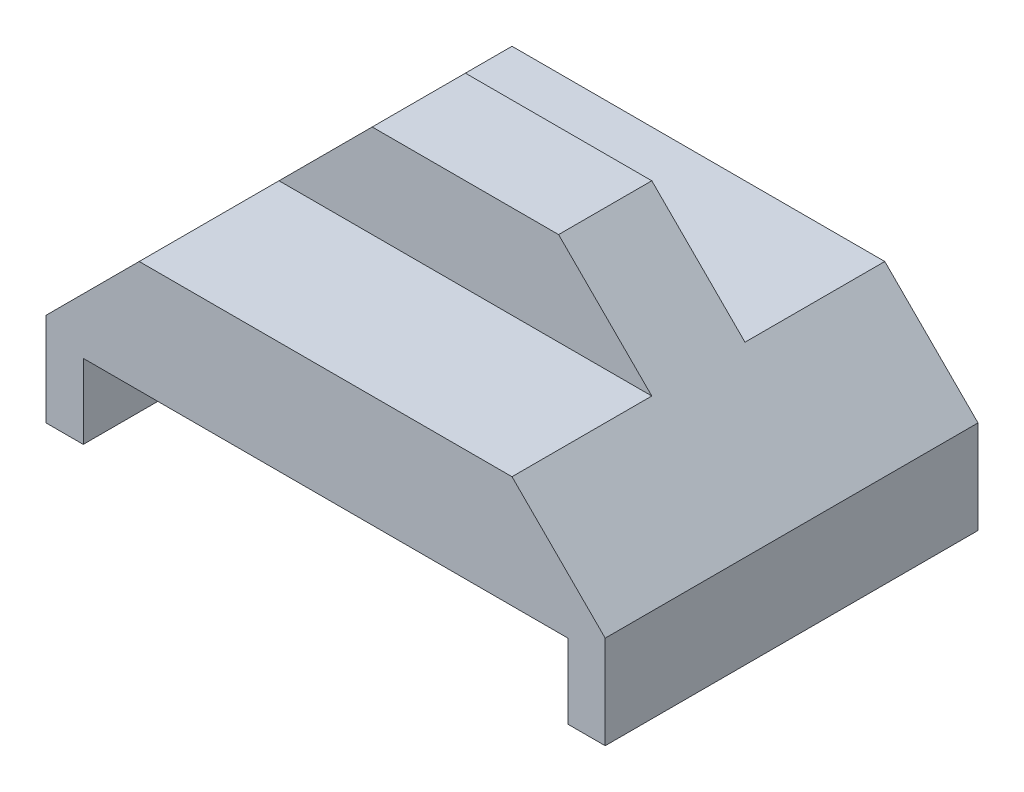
from build123d import *

# Parameters (mm, degrees)
SKETCH_1_W          = 30
SKETCH_1_H          = 20
EXTRUDE_1_DEPTH     = 10
SKETCH_2_W          = 26
SKETCH_2_H          = 4
CUT_EXTRUDE_1_DEPTH = 38.416573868
EXTRUDE_2_DEPTH     = 2.5


with BuildPart() as part:
    # Sketch 1 → Extrude 1 (new body)
    with BuildSketch(Plane(origin=(0, 0, 0), x_dir=(1, 0, 0), z_dir=(0, 1, 0))):
        with Locations((15, 10)):
            Rectangle(SKETCH_1_W, SKETCH_1_H)
    extrude(amount=EXTRUDE_1_DEPTH)

    # Sketch 2 → Cut-Extrude 1 (cut, through all)
    with BuildSketch(Plane.XY):
        with Locations((15, 2)):
            Rectangle(SKETCH_2_W, SKETCH_2_H)
        Polygon((0, 5), (5, 10), (0, 10), align=None)
        Polygon((30, 10), (30, 5), (25, 10), align=None)
    extrude(amount=-CUT_EXTRUDE_1_DEPTH, mode=Mode.SUBTRACT)

    # Sketch 3 → Extrude 2 (add, symmetric)
    with BuildSketch(Plane.XY.offset(-10)):
        Polygon((5, 10), (10, 15), (20, 15), (25, 10), align=None)
    extrude(amount=EXTRUDE_2_DEPTH, both=True)


solid = part.part
